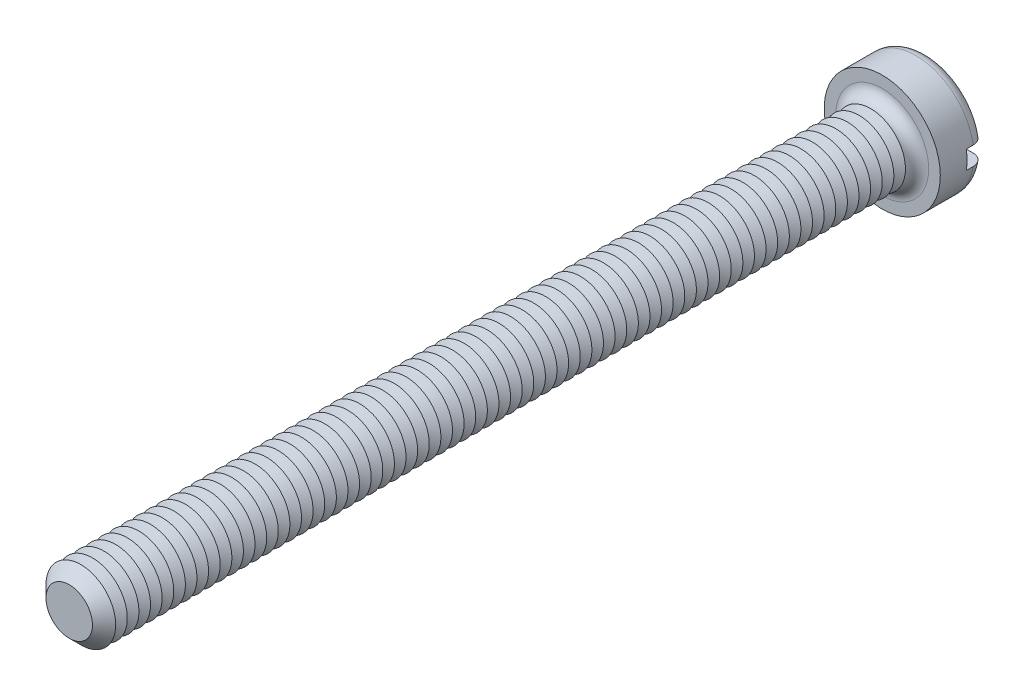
from build123d import *

# Parameters (mm, degrees)
SKETCH3_R           = 5
BOSS_EXTRUDE2_DEPTH = 3.9
SKETCH4_R           = 3
BOSS_EXTRUDE3_DEPTH = 70
FILLET1_R           = 1
CHAMFER1_SIZE       = 1
LPATTERN1_COUNT     = 68
LPATTERN1_PITCH     = 1
SKETCH8_W           = 10
SKETCH8_H           = 1.6
CUT_EXTRUDE1_DEPTH  = 1.6


with BuildPart() as part:
    # Sketch3 → Boss-Extrude2 (new body)
    with BuildSketch(Plane.XY):
        Circle(SKETCH3_R)
    extrude(amount=-BOSS_EXTRUDE2_DEPTH)

    # Sketch4 → Boss-Extrude3 (add)
    with BuildSketch(Plane.XY):
        Circle(SKETCH4_R)
    extrude(amount=BOSS_EXTRUDE3_DEPTH)

    # Fillet1
    fillet1_edges = [part.edges().sort_by_distance(p)[0] for p in [
        (-5, 0, -3.9),
        (-3, 0, 0),
    ]]
    fillet(fillet1_edges, radius=FILLET1_R)

    # Chamfer1
    chamfer1_edges = [part.edges().sort_by_distance(p)[0] for p in [
        (-3, 0, 70),
    ]]
    chamfer(chamfer1_edges, length=CHAMFER1_SIZE)

    # Sketch6 → Cut-Revolve1 (revolve, cut)
    with BuildSketch(Plane(origin=(0, 0, 0), x_dir=(0, 0, -1), z_dir=(1, 0, 0)), mode=Mode.PRIVATE) as cut_revolve1_sk:
        Polygon((-1, 3), (-1.5, 2.133974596), (-2, 3), align=None)
    cut_revolve1 = revolve(cut_revolve1_sk.sketch.rotate(Axis((0, 0, -1.694361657), (0, 0, 1)), 90), axis=Axis((0, 0, -1.694361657), (0, 0, 1)), mode=Mode.SUBTRACT)

    # LPattern1: Cut-Revolve1 ×68
    with Locations(*[(0, 0, i * LPATTERN1_PITCH) for i in range(1, LPATTERN1_COUNT)]):
        add(cut_revolve1, mode=Mode.SUBTRACT)

    # Sketch8 → Cut-Extrude1 (cut)
    with BuildSketch(Plane(origin=(0, 0, -3.9), x_dir=(-1, 0, 0), z_dir=(0, 0, -1))):
        Rectangle(SKETCH8_W, SKETCH8_H)
    extrude(amount=-CUT_EXTRUDE1_DEPTH, mode=Mode.SUBTRACT)


solid = part.part
